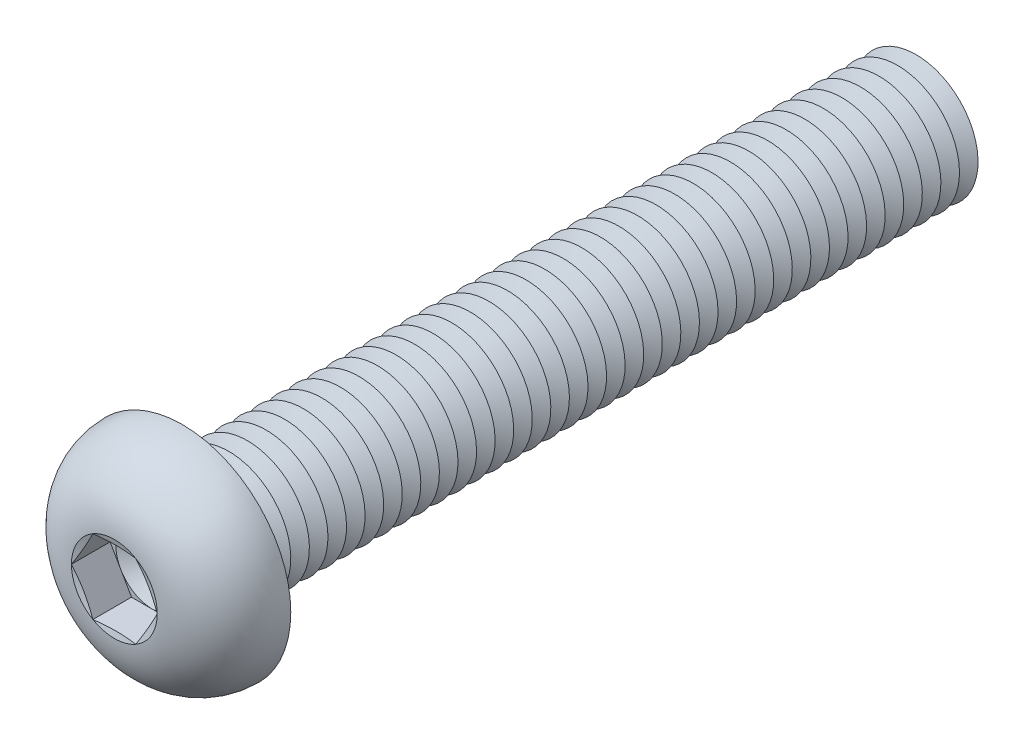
from build123d import *

# Parameters (mm, degrees)
FILLET1_R          = 0.75
LPATTERN1_COUNT    = 40
LPATTERN1_PITCH    = 1.5
CUT_EXTRUDE1_DEPTH = 3.12


with BuildPart() as part:
    # Sketch1 → Revolve1 (revolve)
    with BuildSketch(Plane(origin=(0, 0, 0), x_dir=(0, 0, -1), z_dir=(1, 0, 0))):
        with BuildLine():
            Line((0, 5), (0, 8.75))
            ThreePointArc((0, 8.75), (-3.814142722, 7.21429474), (-5.5, 3.4641))
            Line((-5.5, 3.4641), (-5.035898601, 1.73205))
            Line((-5.035898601, 1.73205), (-5.5, 1.73205))
            Line((-5.5, 1.73205), (-5.5, 0))
            Line((-5.5, 0), (60, 0))
            Line((60, 0), (60, 5))
            Line((60, 5), (0, 5))
        make_face()
    revolve(axis=Axis((0, 0, -60), (0, 0, 1)))

    # Fillet1
    fillet1_edges = [part.edges().sort_by_distance(p)[0] for p in [
        (0, -5, 0),
    ]]
    fillet(fillet1_edges, radius=FILLET1_R)

    # Sketch2 → Cut-Revolve1 (revolve, cut)
    with BuildSketch(Plane(origin=(0, 0, 0), x_dir=(0, 0, -1), z_dir=(1, 0, 0))):
        Polygon((59.25, 5), (60.75, 5), (60, 3.700961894), align=None)
    cut_revolve1 = revolve(axis=Axis((0, 0, -60), (0, 0, -1)), mode=Mode.SUBTRACT)

    # LPattern1: Cut-Revolve1 ×40
    with Locations(*[(0, 0, i * LPATTERN1_PITCH) for i in range(1, LPATTERN1_COUNT)]):
        add(cut_revolve1, mode=Mode.SUBTRACT)

    # Sketch3 → Cut-Extrude1 (cut)
    with BuildSketch(Plane.XY.offset(5.5)):
        Polygon((1.73205, 2.999998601), (-1.73205, 2.999998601), (-3.4641, 0), (-1.73205, -2.999998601), (1.73205, -2.999998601), (3.4641, 0), align=None)
    extrude(amount=-CUT_EXTRUDE1_DEPTH, mode=Mode.SUBTRACT)

    # Cut-Extrude2 cone 1 section (on through the dimple's axis) → Cut-Extrude2 (revolve, cut)
    with BuildSketch(Plane(origin=(0, 0, 2.38), x_dir=(0, -1, 0), z_dir=(1, 0, 0))):
        Polygon((0, 0), (2.999998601, 0), (0, 1.73205), align=None)
    revolve(axis=Axis((0, 0, 2.38), (0, 0, -1)), mode=Mode.SUBTRACT)


solid = part.part
